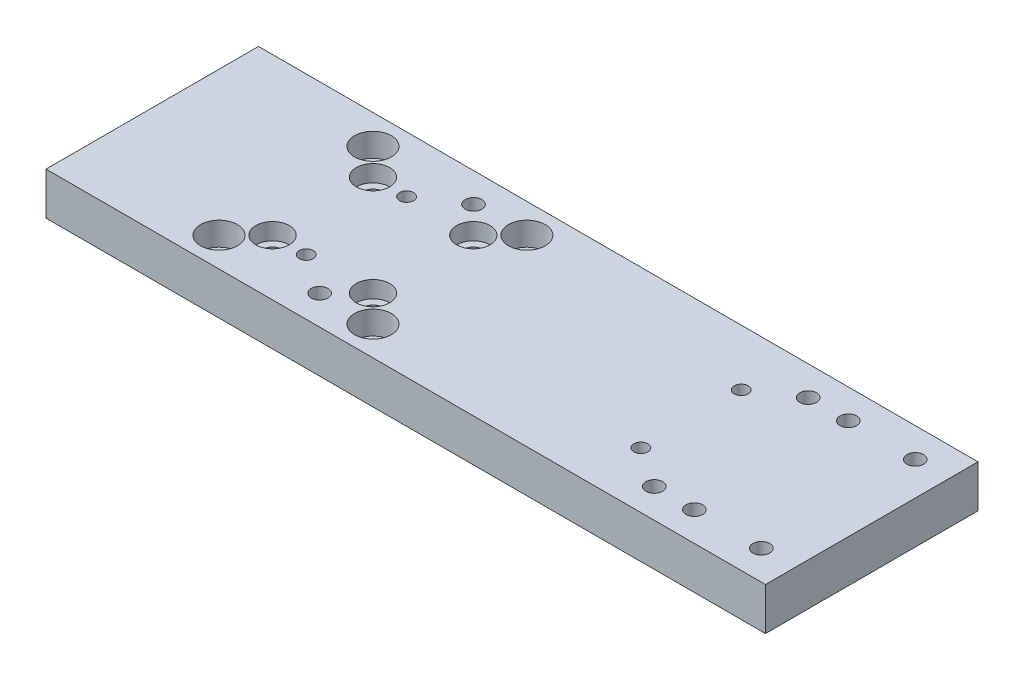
ISO-10303-21;
HEADER;
FILE_DESCRIPTION(('STEP AP214'),'2;1');
FILE_NAME('part.step','',(''),(''),'','','');
FILE_SCHEMA(('AUTOMOTIVE_DESIGN { 1 0 10303 214 1 1 1 1 }'));
ENDSEC;
DATA;
#1=APPLICATION_CONTEXT('core data for automotive mechanical design processes');
#2=APPLICATION_PROTOCOL_DEFINITION('international standard','automotive_design',2000,#1);
#3=PRODUCT_CONTEXT('',#1,'mechanical');
#4=PRODUCT('Part','Part','',(#3));
#5=PRODUCT_RELATED_PRODUCT_CATEGORY('part','',(#4));
#6=PRODUCT_DEFINITION_FORMATION('','',#4);
#7=PRODUCT_DEFINITION_CONTEXT('part definition',#1,'design');
#8=PRODUCT_DEFINITION('design','',#6,#7);
#9=PRODUCT_DEFINITION_SHAPE('','',#8);
#10=(LENGTH_UNIT() NAMED_UNIT(*) SI_UNIT(.MILLI.,.METRE.));
#11=(NAMED_UNIT(*) PLANE_ANGLE_UNIT() SI_UNIT($,.RADIAN.));
#12=(NAMED_UNIT(*) SI_UNIT($,.STERADIAN.) SOLID_ANGLE_UNIT());
#13=UNCERTAINTY_MEASURE_WITH_UNIT(LENGTH_MEASURE(1.E-05),#10,'distance_accuracy_value','');
#14=(GEOMETRIC_REPRESENTATION_CONTEXT(3) GLOBAL_UNCERTAINTY_ASSIGNED_CONTEXT((#13)) GLOBAL_UNIT_ASSIGNED_CONTEXT((#10,
#11,#12)) REPRESENTATION_CONTEXT('',''));
#15=CARTESIAN_POINT('',(0.,0.,0.));
#16=DIRECTION('',(0.,0.,1.));
#17=DIRECTION('',(1.,0.,0.));
#18=AXIS2_PLACEMENT_3D('',#15,#16,#17);
#19=CARTESIAN_POINT('',(0.,12.7,0.));
#20=DIRECTION('',(1.,0.,0.));
#21=DIRECTION('',(0.,0.,-1.));
#22=AXIS2_PLACEMENT_3D('',#19,#20,#21);
#23=PLANE('',#22);
#24=DIRECTION('',(0.,0.,1.));
#25=VECTOR('',#24,1.);
#26=CARTESIAN_POINT('',(0.,0.,0.));
#27=LINE('',#26,#25);
#28=CARTESIAN_POINT('',(0.,0.,-63.5));
#29=VERTEX_POINT('',#28);
#30=CARTESIAN_POINT('',(0.,0.,0.));
#31=VERTEX_POINT('',#30);
#32=EDGE_CURVE('E91',#29,#31,#27,.T.);
#33=ORIENTED_EDGE('',*,*,#32,.T.);
#34=DIRECTION('',(0.,-1.,0.));
#35=VECTOR('',#34,1.);
#36=CARTESIAN_POINT('',(0.,12.7,0.));
#37=LINE('',#36,#35);
#38=CARTESIAN_POINT('',(0.,12.7,0.));
#39=VERTEX_POINT('',#38);
#40=EDGE_CURVE('E12',#39,#31,#37,.T.);
#41=ORIENTED_EDGE('',*,*,#40,.F.);
#42=DIRECTION('',(0.,0.,1.));
#43=VECTOR('',#42,1.);
#44=CARTESIAN_POINT('',(0.,12.7,0.));
#45=LINE('',#44,#43);
#46=CARTESIAN_POINT('',(0.,12.7,-63.5));
#47=VERTEX_POINT('',#46);
#48=EDGE_CURVE('E82',#47,#39,#45,.T.);
#49=ORIENTED_EDGE('',*,*,#48,.F.);
#50=DIRECTION('',(0.,-1.,0.));
#51=VECTOR('',#50,1.);
#52=CARTESIAN_POINT('',(0.,12.7,-63.5));
#53=LINE('',#52,#51);
#54=EDGE_CURVE('E92',#47,#29,#53,.T.);
#55=ORIENTED_EDGE('',*,*,#54,.T.);
#56=EDGE_LOOP('',(#33,#41,#49,#55));
#57=FACE_BOUND('',#56,.T.);
#58=ADVANCED_FACE('F37',(#57),#23,.F.);
#59=CARTESIAN_POINT('',(0.,12.7,0.));
#60=DIRECTION('',(0.,0.,-1.));
#61=DIRECTION('',(-1.,0.,0.));
#62=AXIS2_PLACEMENT_3D('',#59,#60,#61);
#63=PLANE('',#62);
#64=DIRECTION('',(1.,0.,0.));
#65=VECTOR('',#64,1.);
#66=CARTESIAN_POINT('',(0.,0.,0.));
#67=LINE('',#66,#65);
#68=CARTESIAN_POINT('',(215.,0.,0.));
#69=VERTEX_POINT('',#68);
#70=EDGE_CURVE('E95',#31,#69,#67,.T.);
#71=ORIENTED_EDGE('',*,*,#70,.T.);
#72=DIRECTION('',(0.,-1.,0.));
#73=VECTOR('',#72,1.);
#74=CARTESIAN_POINT('',(215.,12.7,0.));
#75=LINE('',#74,#73);
#76=CARTESIAN_POINT('',(215.,12.7,0.));
#77=VERTEX_POINT('',#76);
#78=EDGE_CURVE('E47',#77,#69,#75,.T.);
#79=ORIENTED_EDGE('',*,*,#78,.F.);
#80=DIRECTION('',(1.,0.,0.));
#81=VECTOR('',#80,1.);
#82=CARTESIAN_POINT('',(0.,12.7,0.));
#83=LINE('',#82,#81);
#84=EDGE_CURVE('E73',#39,#77,#83,.T.);
#85=ORIENTED_EDGE('',*,*,#84,.F.);
#86=ORIENTED_EDGE('',*,*,#40,.T.);
#87=EDGE_LOOP('',(#71,#79,#85,#86));
#88=FACE_BOUND('',#87,.T.);
#89=ADVANCED_FACE('F76',(#88),#63,.F.);
#90=CARTESIAN_POINT('',(215.,12.7,0.));
#91=DIRECTION('',(-1.,0.,0.));
#92=DIRECTION('',(0.,0.,1.));
#93=AXIS2_PLACEMENT_3D('',#90,#91,#92);
#94=PLANE('',#93);
#95=DIRECTION('',(0.,0.,-1.));
#96=VECTOR('',#95,1.);
#97=CARTESIAN_POINT('',(215.,0.,-63.5));
#98=LINE('',#97,#96);
#99=CARTESIAN_POINT('',(215.,0.,-63.5));
#100=VERTEX_POINT('',#99);
#101=EDGE_CURVE('E98',#69,#100,#98,.T.);
#102=ORIENTED_EDGE('',*,*,#101,.T.);
#103=DIRECTION('',(0.,-1.,0.));
#104=VECTOR('',#103,1.);
#105=CARTESIAN_POINT('',(215.,12.7,-63.5));
#106=LINE('',#105,#104);
#107=CARTESIAN_POINT('',(215.,12.7,-63.5));
#108=VERTEX_POINT('',#107);
#109=EDGE_CURVE('E41',#108,#100,#106,.T.);
#110=ORIENTED_EDGE('',*,*,#109,.F.);
#111=DIRECTION('',(0.,0.,-1.));
#112=VECTOR('',#111,1.);
#113=CARTESIAN_POINT('',(215.,12.7,-63.5));
#114=LINE('',#113,#112);
#115=EDGE_CURVE('E81',#77,#108,#114,.T.);
#116=ORIENTED_EDGE('',*,*,#115,.F.);
#117=ORIENTED_EDGE('',*,*,#78,.T.);
#118=EDGE_LOOP('',(#102,#110,#116,#117));
#119=FACE_BOUND('',#118,.T.);
#120=ADVANCED_FACE('F39',(#119),#94,.F.);
#121=CARTESIAN_POINT('',(0.,12.7,-63.5));
#122=DIRECTION('',(0.,0.,1.));
#123=DIRECTION('',(1.,0.,0.));
#124=AXIS2_PLACEMENT_3D('',#121,#122,#123);
#125=PLANE('',#124);
#126=DIRECTION('',(-1.,0.,0.));
#127=VECTOR('',#126,1.);
#128=CARTESIAN_POINT('',(0.,0.,-63.5));
#129=LINE('',#128,#127);
#130=EDGE_CURVE('E88',#100,#29,#129,.T.);
#131=ORIENTED_EDGE('',*,*,#130,.T.);
#132=ORIENTED_EDGE('',*,*,#54,.F.);
#133=DIRECTION('',(-1.,0.,0.));
#134=VECTOR('',#133,1.);
#135=CARTESIAN_POINT('',(0.,12.7,-63.5));
#136=LINE('',#135,#134);
#137=EDGE_CURVE('E56',#108,#47,#136,.T.);
#138=ORIENTED_EDGE('',*,*,#137,.F.);
#139=ORIENTED_EDGE('',*,*,#109,.T.);
#140=EDGE_LOOP('',(#131,#132,#138,#139));
#141=FACE_BOUND('',#140,.T.);
#142=ADVANCED_FACE('F114',(#141),#125,.F.);
#143=CARTESIAN_POINT('',(0.,12.7,-63.5));
#144=DIRECTION('',(0.,-1.,0.));
#145=DIRECTION('',(0.,0.,-1.));
#146=AXIS2_PLACEMENT_3D('',#143,#144,#145);
#147=PLANE('',#146);
#148=CARTESIAN_POINT('',(173.,12.7,-54.75));
#149=DIRECTION('',(0.,1.,0.));
#150=DIRECTION('',(0.,0.,1.));
#151=AXIS2_PLACEMENT_3D('',#148,#149,#150);
#152=CIRCLE('',#151,2.49999999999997);
#153=CARTESIAN_POINT('',(173.,12.7,-52.2500000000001));
#154=VERTEX_POINT('',#153);
#155=EDGE_CURVE('E711',#154,#154,#152,.T.);
#156=ORIENTED_EDGE('',*,*,#155,.F.);
#157=EDGE_LOOP('',(#156));
#158=FACE_BOUND('',#157,.T.);
#159=CARTESIAN_POINT('',(173.,12.7,-8.75000000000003));
#160=DIRECTION('',(0.,1.,0.));
#161=DIRECTION('',(0.,0.,1.));
#162=AXIS2_PLACEMENT_3D('',#159,#160,#161);
#163=CIRCLE('',#162,2.49999999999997);
#164=CARTESIAN_POINT('',(173.,12.7,-6.25000000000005));
#165=VERTEX_POINT('',#164);
#166=EDGE_CURVE('E706',#165,#165,#163,.T.);
#167=ORIENTED_EDGE('',*,*,#166,.F.);
#168=EDGE_LOOP('',(#167));
#169=FACE_BOUND('',#168,.T.);
#170=CARTESIAN_POINT('',(73.,12.7,-8.75000000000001));
#171=DIRECTION('',(0.,1.,0.));
#172=DIRECTION('',(0.,0.,1.));
#173=AXIS2_PLACEMENT_3D('',#170,#171,#172);
#174=CIRCLE('',#173,2.49999999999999);
#175=CARTESIAN_POINT('',(73.,12.7,-6.25000000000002));
#176=VERTEX_POINT('',#175);
#177=EDGE_CURVE('E700',#176,#176,#174,.T.);
#178=ORIENTED_EDGE('',*,*,#177,.F.);
#179=EDGE_LOOP('',(#178));
#180=FACE_BOUND('',#179,.T.);
#181=CARTESIAN_POINT('',(73.,12.7,-54.75));
#182=DIRECTION('',(0.,1.,0.));
#183=DIRECTION('',(0.,0.,1.));
#184=AXIS2_PLACEMENT_3D('',#181,#182,#183);
#185=CIRCLE('',#184,2.49999999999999);
#186=CARTESIAN_POINT('',(73.,12.7,-52.25));
#187=VERTEX_POINT('',#186);
#188=EDGE_CURVE('E694',#187,#187,#185,.T.);
#189=ORIENTED_EDGE('',*,*,#188,.F.);
#190=EDGE_LOOP('',(#189));
#191=FACE_BOUND('',#190,.T.);
#192=CARTESIAN_POINT('',(205.,12.7,-8.75000000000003));
#193=DIRECTION('',(0.,1.,0.));
#194=DIRECTION('',(0.,0.,1.));
#195=AXIS2_PLACEMENT_3D('',#192,#193,#194);
#196=CIRCLE('',#195,2.5);
#197=CARTESIAN_POINT('',(205.,12.7,-6.25000000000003));
#198=VERTEX_POINT('',#197);
#199=EDGE_CURVE('E688',#198,#198,#196,.T.);
#200=ORIENTED_EDGE('',*,*,#199,.F.);
#201=EDGE_LOOP('',(#200));
#202=FACE_BOUND('',#201,.T.);
#203=CARTESIAN_POINT('',(205.,12.7,-54.75));
#204=DIRECTION('',(0.,1.,0.));
#205=DIRECTION('',(0.,0.,1.));
#206=AXIS2_PLACEMENT_3D('',#203,#204,#205);
#207=CIRCLE('',#206,2.5);
#208=CARTESIAN_POINT('',(205.,12.7,-52.25));
#209=VERTEX_POINT('',#208);
#210=EDGE_CURVE('E682',#209,#209,#207,.T.);
#211=ORIENTED_EDGE('',*,*,#210,.F.);
#212=EDGE_LOOP('',(#211));
#213=FACE_BOUND('',#212,.T.);
#214=CARTESIAN_POINT('',(185.,12.7,-54.75));
#215=DIRECTION('',(0.,1.,0.));
#216=DIRECTION('',(0.,0.,1.));
#217=AXIS2_PLACEMENT_3D('',#214,#215,#216);
#218=CIRCLE('',#217,2.49999999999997);
#219=CARTESIAN_POINT('',(185.,12.7,-52.25));
#220=VERTEX_POINT('',#219);
#221=EDGE_CURVE('E676',#220,#220,#218,.T.);
#222=ORIENTED_EDGE('',*,*,#221,.F.);
#223=EDGE_LOOP('',(#222));
#224=FACE_BOUND('',#223,.T.);
#225=CARTESIAN_POINT('',(185.,12.7,-8.75000000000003));
#226=DIRECTION('',(0.,1.,0.));
#227=DIRECTION('',(0.,0.,1.));
#228=AXIS2_PLACEMENT_3D('',#225,#226,#227);
#229=CIRCLE('',#228,2.49999999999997);
#230=CARTESIAN_POINT('',(185.,12.7,-6.25000000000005));
#231=VERTEX_POINT('',#230);
#232=EDGE_CURVE('E670',#231,#231,#229,.T.);
#233=ORIENTED_EDGE('',*,*,#232,.F.);
#234=EDGE_LOOP('',(#233));
#235=FACE_BOUND('',#234,.T.);
#236=CARTESIAN_POINT('',(88.95,12.7,-8.74999999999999));
#237=DIRECTION('',(0.,1.,0.));
#238=DIRECTION('',(0.,0.,1.));
#239=AXIS2_PLACEMENT_3D('',#236,#237,#238);
#240=CIRCLE('',#239,5.50000000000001);
#241=CARTESIAN_POINT('',(88.95,12.7,-3.24999999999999));
#242=VERTEX_POINT('',#241);
#243=EDGE_CURVE('E664',#242,#242,#240,.T.);
#244=ORIENTED_EDGE('',*,*,#243,.F.);
#245=EDGE_LOOP('',(#244));
#246=FACE_BOUND('',#245,.T.);
#247=CARTESIAN_POINT('',(88.95,12.7,-54.75));
#248=DIRECTION('',(0.,1.,0.));
#249=DIRECTION('',(0.,0.,1.));
#250=AXIS2_PLACEMENT_3D('',#247,#248,#249);
#251=CIRCLE('',#250,5.49999999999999);
#252=CARTESIAN_POINT('',(88.95,12.7,-49.25));
#253=VERTEX_POINT('',#252);
#254=EDGE_CURVE('E652',#253,#253,#251,.T.);
#255=ORIENTED_EDGE('',*,*,#254,.F.);
#256=EDGE_LOOP('',(#255));
#257=FACE_BOUND('',#256,.T.);
#258=CARTESIAN_POINT('',(42.95,12.7,-54.75));
#259=DIRECTION('',(0.,1.,0.));
#260=DIRECTION('',(0.,0.,1.));
#261=AXIS2_PLACEMENT_3D('',#258,#259,#260);
#262=CIRCLE('',#261,5.5);
#263=CARTESIAN_POINT('',(42.95,12.7,-49.25));
#264=VERTEX_POINT('',#263);
#265=EDGE_CURVE('E640',#264,#264,#262,.T.);
#266=ORIENTED_EDGE('',*,*,#265,.F.);
#267=EDGE_LOOP('',(#266));
#268=FACE_BOUND('',#267,.T.);
#269=CARTESIAN_POINT('',(42.95,12.7,-8.74999999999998));
#270=DIRECTION('',(0.,1.,0.));
#271=DIRECTION('',(0.,0.,1.));
#272=AXIS2_PLACEMENT_3D('',#269,#270,#271);
#273=CIRCLE('',#272,5.5);
#274=CARTESIAN_POINT('',(42.95,12.7,-3.24999999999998));
#275=VERTEX_POINT('',#274);
#276=EDGE_CURVE('E628',#275,#275,#273,.T.);
#277=ORIENTED_EDGE('',*,*,#276,.F.);
#278=EDGE_LOOP('',(#277));
#279=FACE_BOUND('',#278,.T.);
#280=CARTESIAN_POINT('',(80.95,12.7,-46.75));
#281=DIRECTION('',(0.,1.,0.));
#282=DIRECTION('',(0.,0.,1.));
#283=AXIS2_PLACEMENT_3D('',#280,#281,#282);
#284=CIRCLE('',#283,5.);
#285=CARTESIAN_POINT('',(80.95,12.7,-41.75));
#286=VERTEX_POINT('',#285);
#287=EDGE_CURVE('E616',#286,#286,#284,.T.);
#288=ORIENTED_EDGE('',*,*,#287,.F.);
#289=EDGE_LOOP('',(#288));
#290=FACE_BOUND('',#289,.T.);
#291=CARTESIAN_POINT('',(80.95,12.7,-16.75));
#292=DIRECTION('',(0.,1.,0.));
#293=DIRECTION('',(0.,0.,1.));
#294=AXIS2_PLACEMENT_3D('',#291,#292,#293);
#295=CIRCLE('',#294,5.);
#296=CARTESIAN_POINT('',(80.95,12.7,-11.75));
#297=VERTEX_POINT('',#296);
#298=EDGE_CURVE('E604',#297,#297,#295,.T.);
#299=ORIENTED_EDGE('',*,*,#298,.F.);
#300=EDGE_LOOP('',(#299));
#301=FACE_BOUND('',#300,.T.);
#302=CARTESIAN_POINT('',(50.95,12.7,-16.75));
#303=DIRECTION('',(0.,1.,0.));
#304=DIRECTION('',(0.,0.,1.));
#305=AXIS2_PLACEMENT_3D('',#302,#303,#304);
#306=CIRCLE('',#305,5.);
#307=CARTESIAN_POINT('',(50.95,12.7,-11.75));
#308=VERTEX_POINT('',#307);
#309=EDGE_CURVE('E592',#308,#308,#306,.T.);
#310=ORIENTED_EDGE('',*,*,#309,.F.);
#311=EDGE_LOOP('',(#310));
#312=FACE_BOUND('',#311,.T.);
#313=CARTESIAN_POINT('',(50.95,12.7,-46.75));
#314=DIRECTION('',(0.,1.,0.));
#315=DIRECTION('',(0.,0.,1.));
#316=AXIS2_PLACEMENT_3D('',#313,#314,#315);
#317=CIRCLE('',#316,5.);
#318=CARTESIAN_POINT('',(50.95,12.7,-41.75));
#319=VERTEX_POINT('',#318);
#320=EDGE_CURVE('E580',#319,#319,#317,.T.);
#321=ORIENTED_EDGE('',*,*,#320,.F.);
#322=EDGE_LOOP('',(#321));
#323=FACE_BOUND('',#322,.T.);
#324=CARTESIAN_POINT('',(161.,12.7,-16.75));
#325=DIRECTION('',(0.,1.,0.));
#326=DIRECTION('',(0.,0.,1.));
#327=AXIS2_PLACEMENT_3D('',#324,#325,#326);
#328=CIRCLE('',#327,2.09999999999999);
#329=CARTESIAN_POINT('',(161.,12.7,-14.65));
#330=VERTEX_POINT('',#329);
#331=EDGE_CURVE('E568',#330,#330,#328,.T.);
#332=ORIENTED_EDGE('',*,*,#331,.F.);
#333=EDGE_LOOP('',(#332));
#334=FACE_BOUND('',#333,.T.);
#335=CARTESIAN_POINT('',(161.,12.7,-46.75));
#336=DIRECTION('',(0.,1.,0.));
#337=DIRECTION('',(0.,0.,1.));
#338=AXIS2_PLACEMENT_3D('',#335,#336,#337);
#339=CIRCLE('',#338,2.09999999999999);
#340=CARTESIAN_POINT('',(161.,12.7,-44.65));
#341=VERTEX_POINT('',#340);
#342=EDGE_CURVE('E555',#341,#341,#339,.T.);
#343=ORIENTED_EDGE('',*,*,#342,.F.);
#344=EDGE_LOOP('',(#343));
#345=FACE_BOUND('',#344,.T.);
#346=CARTESIAN_POINT('',(61.,12.7,-46.75));
#347=DIRECTION('',(0.,1.,0.));
#348=DIRECTION('',(0.,0.,1.));
#349=AXIS2_PLACEMENT_3D('',#346,#347,#348);
#350=CIRCLE('',#349,2.1);
#351=CARTESIAN_POINT('',(61.,12.7,-44.65));
#352=VERTEX_POINT('',#351);
#353=EDGE_CURVE('E549',#352,#352,#350,.T.);
#354=ORIENTED_EDGE('',*,*,#353,.F.);
#355=EDGE_LOOP('',(#354));
#356=FACE_BOUND('',#355,.T.);
#357=CARTESIAN_POINT('',(61.,12.7,-16.75));
#358=DIRECTION('',(0.,1.,0.));
#359=DIRECTION('',(0.,0.,1.));
#360=AXIS2_PLACEMENT_3D('',#357,#358,#359);
#361=CIRCLE('',#360,2.1);
#362=CARTESIAN_POINT('',(61.,12.7,-14.65));
#363=VERTEX_POINT('',#362);
#364=EDGE_CURVE('E101',#363,#363,#361,.T.);
#365=ORIENTED_EDGE('',*,*,#364,.F.);
#366=EDGE_LOOP('',(#365));
#367=FACE_BOUND('',#366,.T.);
#368=ORIENTED_EDGE('',*,*,#48,.T.);
#369=ORIENTED_EDGE('',*,*,#84,.T.);
#370=ORIENTED_EDGE('',*,*,#115,.T.);
#371=ORIENTED_EDGE('',*,*,#137,.T.);
#372=EDGE_LOOP('',(#368,#369,#370,#371));
#373=FACE_BOUND('',#372,.T.);
#374=ADVANCED_FACE('F85',(#158,#169,#180,#191,#202,#213,#224,#235,#246,#257,#268,#279,#290,#301,
#312,#323,#334,#345,#356,#367,#373),#147,.F.);
#375=CARTESIAN_POINT('',(0.,0.,-63.5));
#376=DIRECTION('',(0.,-1.,0.));
#377=DIRECTION('',(0.,0.,-1.));
#378=AXIS2_PLACEMENT_3D('',#375,#376,#377);
#379=PLANE('',#378);
#380=CARTESIAN_POINT('',(173.,0.,-54.75));
#381=DIRECTION('',(0.,1.,0.));
#382=DIRECTION('',(0.,0.,1.));
#383=AXIS2_PLACEMENT_3D('',#380,#381,#382);
#384=CIRCLE('',#383,2.5);
#385=CARTESIAN_POINT('',(173.,0.,-52.25));
#386=VERTEX_POINT('',#385);
#387=EDGE_CURVE('E709',#386,#386,#384,.T.);
#388=ORIENTED_EDGE('',*,*,#387,.T.);
#389=EDGE_LOOP('',(#388));
#390=FACE_BOUND('',#389,.T.);
#391=CARTESIAN_POINT('',(173.,0.,-8.75000000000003));
#392=DIRECTION('',(0.,1.,0.));
#393=DIRECTION('',(0.,0.,1.));
#394=AXIS2_PLACEMENT_3D('',#391,#392,#393);
#395=CIRCLE('',#394,2.5);
#396=CARTESIAN_POINT('',(173.,0.,-6.25000000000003));
#397=VERTEX_POINT('',#396);
#398=EDGE_CURVE('E703',#397,#397,#395,.T.);
#399=ORIENTED_EDGE('',*,*,#398,.T.);
#400=EDGE_LOOP('',(#399));
#401=FACE_BOUND('',#400,.T.);
#402=CARTESIAN_POINT('',(73.,0.,-8.75000000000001));
#403=DIRECTION('',(0.,1.,0.));
#404=DIRECTION('',(0.,0.,1.));
#405=AXIS2_PLACEMENT_3D('',#402,#403,#404);
#406=CIRCLE('',#405,2.5);
#407=CARTESIAN_POINT('',(73.,0.,-6.25));
#408=VERTEX_POINT('',#407);
#409=EDGE_CURVE('E697',#408,#408,#406,.T.);
#410=ORIENTED_EDGE('',*,*,#409,.T.);
#411=EDGE_LOOP('',(#410));
#412=FACE_BOUND('',#411,.T.);
#413=CARTESIAN_POINT('',(73.,0.,-54.75));
#414=DIRECTION('',(0.,1.,0.));
#415=DIRECTION('',(0.,0.,1.));
#416=AXIS2_PLACEMENT_3D('',#413,#414,#415);
#417=CIRCLE('',#416,2.5);
#418=CARTESIAN_POINT('',(73.,0.,-52.25));
#419=VERTEX_POINT('',#418);
#420=EDGE_CURVE('E691',#419,#419,#417,.T.);
#421=ORIENTED_EDGE('',*,*,#420,.T.);
#422=EDGE_LOOP('',(#421));
#423=FACE_BOUND('',#422,.T.);
#424=CARTESIAN_POINT('',(205.,0.,-8.75000000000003));
#425=DIRECTION('',(0.,1.,0.));
#426=DIRECTION('',(0.,0.,1.));
#427=AXIS2_PLACEMENT_3D('',#424,#425,#426);
#428=CIRCLE('',#427,2.5);
#429=CARTESIAN_POINT('',(205.,0.,-6.25000000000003));
#430=VERTEX_POINT('',#429);
#431=EDGE_CURVE('E685',#430,#430,#428,.T.);
#432=ORIENTED_EDGE('',*,*,#431,.T.);
#433=EDGE_LOOP('',(#432));
#434=FACE_BOUND('',#433,.T.);
#435=CARTESIAN_POINT('',(205.,0.,-54.75));
#436=DIRECTION('',(0.,1.,0.));
#437=DIRECTION('',(0.,0.,1.));
#438=AXIS2_PLACEMENT_3D('',#435,#436,#437);
#439=CIRCLE('',#438,2.5);
#440=CARTESIAN_POINT('',(205.,0.,-52.25));
#441=VERTEX_POINT('',#440);
#442=EDGE_CURVE('E679',#441,#441,#439,.T.);
#443=ORIENTED_EDGE('',*,*,#442,.T.);
#444=EDGE_LOOP('',(#443));
#445=FACE_BOUND('',#444,.T.);
#446=CARTESIAN_POINT('',(185.,0.,-54.75));
#447=DIRECTION('',(0.,1.,0.));
#448=DIRECTION('',(0.,0.,1.));
#449=AXIS2_PLACEMENT_3D('',#446,#447,#448);
#450=CIRCLE('',#449,2.5);
#451=CARTESIAN_POINT('',(185.,0.,-52.25));
#452=VERTEX_POINT('',#451);
#453=EDGE_CURVE('E673',#452,#452,#450,.T.);
#454=ORIENTED_EDGE('',*,*,#453,.T.);
#455=EDGE_LOOP('',(#454));
#456=FACE_BOUND('',#455,.T.);
#457=CARTESIAN_POINT('',(185.,0.,-8.75000000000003));
#458=DIRECTION('',(0.,1.,0.));
#459=DIRECTION('',(0.,0.,1.));
#460=AXIS2_PLACEMENT_3D('',#457,#458,#459);
#461=CIRCLE('',#460,2.5);
#462=CARTESIAN_POINT('',(185.,0.,-6.25000000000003));
#463=VERTEX_POINT('',#462);
#464=EDGE_CURVE('E667',#463,#463,#461,.T.);
#465=ORIENTED_EDGE('',*,*,#464,.T.);
#466=EDGE_LOOP('',(#465));
#467=FACE_BOUND('',#466,.T.);
#468=CARTESIAN_POINT('',(88.95,0.,-8.74999999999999));
#469=DIRECTION('',(0.,1.,0.));
#470=DIRECTION('',(0.,0.,1.));
#471=AXIS2_PLACEMENT_3D('',#468,#469,#470);
#472=CIRCLE('',#471,3.3);
#473=CARTESIAN_POINT('',(88.95,0.,-5.45));
#474=VERTEX_POINT('',#473);
#475=EDGE_CURVE('E655',#474,#474,#472,.T.);
#476=ORIENTED_EDGE('',*,*,#475,.T.);
#477=EDGE_LOOP('',(#476));
#478=FACE_BOUND('',#477,.T.);
#479=CARTESIAN_POINT('',(88.95,0.,-54.75));
#480=DIRECTION('',(0.,1.,0.));
#481=DIRECTION('',(0.,0.,1.));
#482=AXIS2_PLACEMENT_3D('',#479,#480,#481);
#483=CIRCLE('',#482,3.3);
#484=CARTESIAN_POINT('',(88.95,0.,-51.45));
#485=VERTEX_POINT('',#484);
#486=EDGE_CURVE('E643',#485,#485,#483,.T.);
#487=ORIENTED_EDGE('',*,*,#486,.T.);
#488=EDGE_LOOP('',(#487));
#489=FACE_BOUND('',#488,.T.);
#490=CARTESIAN_POINT('',(42.95,0.,-54.75));
#491=DIRECTION('',(0.,1.,0.));
#492=DIRECTION('',(0.,0.,1.));
#493=AXIS2_PLACEMENT_3D('',#490,#491,#492);
#494=CIRCLE('',#493,3.3);
#495=CARTESIAN_POINT('',(42.95,0.,-51.45));
#496=VERTEX_POINT('',#495);
#497=EDGE_CURVE('E631',#496,#496,#494,.T.);
#498=ORIENTED_EDGE('',*,*,#497,.T.);
#499=EDGE_LOOP('',(#498));
#500=FACE_BOUND('',#499,.T.);
#501=CARTESIAN_POINT('',(42.95,0.,-8.74999999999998));
#502=DIRECTION('',(0.,1.,0.));
#503=DIRECTION('',(0.,0.,1.));
#504=AXIS2_PLACEMENT_3D('',#501,#502,#503);
#505=CIRCLE('',#504,3.3);
#506=CARTESIAN_POINT('',(42.95,0.,-5.44999999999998));
#507=VERTEX_POINT('',#506);
#508=EDGE_CURVE('E619',#507,#507,#505,.T.);
#509=ORIENTED_EDGE('',*,*,#508,.T.);
#510=EDGE_LOOP('',(#509));
#511=FACE_BOUND('',#510,.T.);
#512=CARTESIAN_POINT('',(80.95,0.,-46.75));
#513=DIRECTION('',(0.,1.,0.));
#514=DIRECTION('',(0.,0.,1.));
#515=AXIS2_PLACEMENT_3D('',#512,#513,#514);
#516=CIRCLE('',#515,2.75);
#517=CARTESIAN_POINT('',(80.95,0.,-44.));
#518=VERTEX_POINT('',#517);
#519=EDGE_CURVE('E607',#518,#518,#516,.T.);
#520=ORIENTED_EDGE('',*,*,#519,.T.);
#521=EDGE_LOOP('',(#520));
#522=FACE_BOUND('',#521,.T.);
#523=CARTESIAN_POINT('',(80.95,0.,-16.75));
#524=DIRECTION('',(0.,1.,0.));
#525=DIRECTION('',(0.,0.,1.));
#526=AXIS2_PLACEMENT_3D('',#523,#524,#525);
#527=CIRCLE('',#526,2.75);
#528=CARTESIAN_POINT('',(80.95,0.,-14.));
#529=VERTEX_POINT('',#528);
#530=EDGE_CURVE('E595',#529,#529,#527,.T.);
#531=ORIENTED_EDGE('',*,*,#530,.T.);
#532=EDGE_LOOP('',(#531));
#533=FACE_BOUND('',#532,.T.);
#534=CARTESIAN_POINT('',(50.95,0.,-16.75));
#535=DIRECTION('',(0.,1.,0.));
#536=DIRECTION('',(0.,0.,1.));
#537=AXIS2_PLACEMENT_3D('',#534,#535,#536);
#538=CIRCLE('',#537,2.75);
#539=CARTESIAN_POINT('',(50.95,0.,-14.));
#540=VERTEX_POINT('',#539);
#541=EDGE_CURVE('E583',#540,#540,#538,.T.);
#542=ORIENTED_EDGE('',*,*,#541,.T.);
#543=EDGE_LOOP('',(#542));
#544=FACE_BOUND('',#543,.T.);
#545=CARTESIAN_POINT('',(50.95,0.,-46.75));
#546=DIRECTION('',(0.,1.,0.));
#547=DIRECTION('',(0.,0.,1.));
#548=AXIS2_PLACEMENT_3D('',#545,#546,#547);
#549=CIRCLE('',#548,2.75);
#550=CARTESIAN_POINT('',(50.95,0.,-44.));
#551=VERTEX_POINT('',#550);
#552=EDGE_CURVE('E571',#551,#551,#549,.T.);
#553=ORIENTED_EDGE('',*,*,#552,.T.);
#554=EDGE_LOOP('',(#553));
#555=FACE_BOUND('',#554,.T.);
#556=CARTESIAN_POINT('',(161.,0.,-16.75));
#557=DIRECTION('',(0.,1.,0.));
#558=DIRECTION('',(0.,0.,1.));
#559=AXIS2_PLACEMENT_3D('',#556,#557,#558);
#560=CIRCLE('',#559,2.09999999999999);
#561=CARTESIAN_POINT('',(161.,0.,-14.65));
#562=VERTEX_POINT('',#561);
#563=EDGE_CURVE('E565',#562,#562,#560,.T.);
#564=ORIENTED_EDGE('',*,*,#563,.T.);
#565=EDGE_LOOP('',(#564));
#566=FACE_BOUND('',#565,.T.);
#567=CARTESIAN_POINT('',(161.,0.,-46.75));
#568=DIRECTION('',(0.,1.,0.));
#569=DIRECTION('',(0.,0.,1.));
#570=AXIS2_PLACEMENT_3D('',#567,#568,#569);
#571=CIRCLE('',#570,2.09999999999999);
#572=CARTESIAN_POINT('',(161.,0.,-44.65));
#573=VERTEX_POINT('',#572);
#574=EDGE_CURVE('E551',#573,#573,#571,.T.);
#575=ORIENTED_EDGE('',*,*,#574,.T.);
#576=EDGE_LOOP('',(#575));
#577=FACE_BOUND('',#576,.T.);
#578=CARTESIAN_POINT('',(61.,0.,-46.75));
#579=DIRECTION('',(0.,1.,0.));
#580=DIRECTION('',(0.,0.,1.));
#581=AXIS2_PLACEMENT_3D('',#578,#579,#580);
#582=CIRCLE('',#581,2.09999999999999);
#583=CARTESIAN_POINT('',(61.,0.,-44.65));
#584=VERTEX_POINT('',#583);
#585=EDGE_CURVE('E546',#584,#584,#582,.T.);
#586=ORIENTED_EDGE('',*,*,#585,.T.);
#587=EDGE_LOOP('',(#586));
#588=FACE_BOUND('',#587,.T.);
#589=CARTESIAN_POINT('',(61.,0.,-16.75));
#590=DIRECTION('',(0.,1.,0.));
#591=DIRECTION('',(0.,0.,1.));
#592=AXIS2_PLACEMENT_3D('',#589,#590,#591);
#593=CIRCLE('',#592,2.1);
#594=CARTESIAN_POINT('',(61.,0.,-14.65));
#595=VERTEX_POINT('',#594);
#596=EDGE_CURVE('E96',#595,#595,#593,.T.);
#597=ORIENTED_EDGE('',*,*,#596,.T.);
#598=EDGE_LOOP('',(#597));
#599=FACE_BOUND('',#598,.T.);
#600=ORIENTED_EDGE('',*,*,#32,.F.);
#601=ORIENTED_EDGE('',*,*,#130,.F.);
#602=ORIENTED_EDGE('',*,*,#101,.F.);
#603=ORIENTED_EDGE('',*,*,#70,.F.);
#604=EDGE_LOOP('',(#600,#601,#602,#603));
#605=FACE_BOUND('',#604,.T.);
#606=ADVANCED_FACE('F115',(#390,#401,#412,#423,#434,#445,#456,#467,#478,#489,#500,#511,#522,
#533,#544,#555,#566,#577,#588,#599,#605),#379,.T.);
#607=CARTESIAN_POINT('',(61.,12.7,-16.75));
#608=DIRECTION('',(0.,1.,0.));
#609=DIRECTION('',(0.,0.,1.));
#610=AXIS2_PLACEMENT_3D('',#607,#608,#609);
#611=CYLINDRICAL_SURFACE('',#610,2.1);
#612=ORIENTED_EDGE('',*,*,#596,.F.);
#613=EDGE_LOOP('',(#612));
#614=FACE_BOUND('',#613,.T.);
#615=ORIENTED_EDGE('',*,*,#364,.T.);
#616=EDGE_LOOP('',(#615));
#617=FACE_BOUND('',#616,.T.);
#618=ADVANCED_FACE('F117',(#614,#617),#611,.F.);
#619=CARTESIAN_POINT('',(61.,12.7,-46.75));
#620=DIRECTION('',(0.,1.,0.));
#621=DIRECTION('',(0.,0.,1.));
#622=AXIS2_PLACEMENT_3D('',#619,#620,#621);
#623=CYLINDRICAL_SURFACE('',#622,2.1);
#624=ORIENTED_EDGE('',*,*,#585,.F.);
#625=EDGE_LOOP('',(#624));
#626=FACE_BOUND('',#625,.T.);
#627=ORIENTED_EDGE('',*,*,#353,.T.);
#628=EDGE_LOOP('',(#627));
#629=FACE_BOUND('',#628,.T.);
#630=ADVANCED_FACE('F124',(#626,#629),#623,.F.);
#631=CARTESIAN_POINT('',(161.,12.7,-46.75));
#632=DIRECTION('',(0.,1.,0.));
#633=DIRECTION('',(0.,0.,1.));
#634=AXIS2_PLACEMENT_3D('',#631,#632,#633);
#635=CYLINDRICAL_SURFACE('',#634,2.09999999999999);
#636=ORIENTED_EDGE('',*,*,#574,.F.);
#637=EDGE_LOOP('',(#636));
#638=FACE_BOUND('',#637,.T.);
#639=ORIENTED_EDGE('',*,*,#342,.T.);
#640=EDGE_LOOP('',(#639));
#641=FACE_BOUND('',#640,.T.);
#642=ADVANCED_FACE('F488',(#638,#641),#635,.F.);
#643=CARTESIAN_POINT('',(161.,12.7,-16.75));
#644=DIRECTION('',(0.,1.,0.));
#645=DIRECTION('',(0.,0.,1.));
#646=AXIS2_PLACEMENT_3D('',#643,#644,#645);
#647=CYLINDRICAL_SURFACE('',#646,2.09999999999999);
#648=ORIENTED_EDGE('',*,*,#563,.F.);
#649=EDGE_LOOP('',(#648));
#650=FACE_BOUND('',#649,.T.);
#651=ORIENTED_EDGE('',*,*,#331,.T.);
#652=EDGE_LOOP('',(#651));
#653=FACE_BOUND('',#652,.T.);
#654=ADVANCED_FACE('F477',(#650,#653),#647,.F.);
#655=CARTESIAN_POINT('',(50.95,12.7,-46.75));
#656=DIRECTION('',(0.,1.,0.));
#657=DIRECTION('',(0.,0.,1.));
#658=AXIS2_PLACEMENT_3D('',#655,#656,#657);
#659=CYLINDRICAL_SURFACE('',#658,2.75);
#660=ORIENTED_EDGE('',*,*,#552,.F.);
#661=EDGE_LOOP('',(#660));
#662=FACE_BOUND('',#661,.T.);
#663=CARTESIAN_POINT('',(50.95,7.7,-46.75));
#664=DIRECTION('',(0.,1.,0.));
#665=DIRECTION('',(0.,0.,1.));
#666=AXIS2_PLACEMENT_3D('',#663,#664,#665);
#667=CIRCLE('',#666,2.75);
#668=CARTESIAN_POINT('',(50.95,7.7,-44.));
#669=VERTEX_POINT('',#668);
#670=EDGE_CURVE('E574',#669,#669,#667,.T.);
#671=ORIENTED_EDGE('',*,*,#670,.T.);
#672=EDGE_LOOP('',(#671));
#673=FACE_BOUND('',#672,.T.);
#674=ADVANCED_FACE('F467',(#662,#673),#659,.F.);
#675=CARTESIAN_POINT('',(53.7,7.7,-46.75));
#676=DIRECTION('',(0.,-1.,0.));
#677=DIRECTION('',(0.,0.,-1.));
#678=AXIS2_PLACEMENT_3D('',#675,#676,#677);
#679=PLANE('',#678);
#680=ORIENTED_EDGE('',*,*,#670,.F.);
#681=EDGE_LOOP('',(#680));
#682=FACE_BOUND('',#681,.T.);
#683=CARTESIAN_POINT('',(50.95,7.7,-46.75));
#684=DIRECTION('',(0.,1.,0.));
#685=DIRECTION('',(0.,0.,1.));
#686=AXIS2_PLACEMENT_3D('',#683,#684,#685);
#687=CIRCLE('',#686,5.);
#688=CARTESIAN_POINT('',(50.95,7.7,-41.75));
#689=VERTEX_POINT('',#688);
#690=EDGE_CURVE('E577',#689,#689,#687,.T.);
#691=ORIENTED_EDGE('',*,*,#690,.T.);
#692=EDGE_LOOP('',(#691));
#693=FACE_BOUND('',#692,.T.);
#694=ADVANCED_FACE('F457',(#682,#693),#679,.F.);
#695=CARTESIAN_POINT('',(50.95,12.7,-46.75));
#696=DIRECTION('',(0.,1.,0.));
#697=DIRECTION('',(0.,0.,1.));
#698=AXIS2_PLACEMENT_3D('',#695,#696,#697);
#699=CYLINDRICAL_SURFACE('',#698,5.);
#700=ORIENTED_EDGE('',*,*,#690,.F.);
#701=EDGE_LOOP('',(#700));
#702=FACE_BOUND('',#701,.T.);
#703=ORIENTED_EDGE('',*,*,#320,.T.);
#704=EDGE_LOOP('',(#703));
#705=FACE_BOUND('',#704,.T.);
#706=ADVANCED_FACE('F447',(#702,#705),#699,.F.);
#707=CARTESIAN_POINT('',(50.95,12.7,-16.75));
#708=DIRECTION('',(0.,1.,0.));
#709=DIRECTION('',(0.,0.,1.));
#710=AXIS2_PLACEMENT_3D('',#707,#708,#709);
#711=CYLINDRICAL_SURFACE('',#710,2.75);
#712=ORIENTED_EDGE('',*,*,#541,.F.);
#713=EDGE_LOOP('',(#712));
#714=FACE_BOUND('',#713,.T.);
#715=CARTESIAN_POINT('',(50.95,7.7,-16.75));
#716=DIRECTION('',(0.,1.,0.));
#717=DIRECTION('',(0.,0.,1.));
#718=AXIS2_PLACEMENT_3D('',#715,#716,#717);
#719=CIRCLE('',#718,2.75);
#720=CARTESIAN_POINT('',(50.95,7.7,-14.));
#721=VERTEX_POINT('',#720);
#722=EDGE_CURVE('E586',#721,#721,#719,.T.);
#723=ORIENTED_EDGE('',*,*,#722,.T.);
#724=EDGE_LOOP('',(#723));
#725=FACE_BOUND('',#724,.T.);
#726=ADVANCED_FACE('F437',(#714,#725),#711,.F.);
#727=CARTESIAN_POINT('',(53.7,7.7,-16.75));
#728=DIRECTION('',(0.,-1.,0.));
#729=DIRECTION('',(0.,0.,-1.));
#730=AXIS2_PLACEMENT_3D('',#727,#728,#729);
#731=PLANE('',#730);
#732=ORIENTED_EDGE('',*,*,#722,.F.);
#733=EDGE_LOOP('',(#732));
#734=FACE_BOUND('',#733,.T.);
#735=CARTESIAN_POINT('',(50.95,7.7,-16.75));
#736=DIRECTION('',(0.,1.,0.));
#737=DIRECTION('',(0.,0.,1.));
#738=AXIS2_PLACEMENT_3D('',#735,#736,#737);
#739=CIRCLE('',#738,5.);
#740=CARTESIAN_POINT('',(50.95,7.7,-11.75));
#741=VERTEX_POINT('',#740);
#742=EDGE_CURVE('E589',#741,#741,#739,.T.);
#743=ORIENTED_EDGE('',*,*,#742,.T.);
#744=EDGE_LOOP('',(#743));
#745=FACE_BOUND('',#744,.T.);
#746=ADVANCED_FACE('F427',(#734,#745),#731,.F.);
#747=CARTESIAN_POINT('',(50.95,12.7,-16.75));
#748=DIRECTION('',(0.,1.,0.));
#749=DIRECTION('',(0.,0.,1.));
#750=AXIS2_PLACEMENT_3D('',#747,#748,#749);
#751=CYLINDRICAL_SURFACE('',#750,5.);
#752=ORIENTED_EDGE('',*,*,#742,.F.);
#753=EDGE_LOOP('',(#752));
#754=FACE_BOUND('',#753,.T.);
#755=ORIENTED_EDGE('',*,*,#309,.T.);
#756=EDGE_LOOP('',(#755));
#757=FACE_BOUND('',#756,.T.);
#758=ADVANCED_FACE('F417',(#754,#757),#751,.F.);
#759=CARTESIAN_POINT('',(80.95,12.7,-16.75));
#760=DIRECTION('',(0.,1.,0.));
#761=DIRECTION('',(0.,0.,1.));
#762=AXIS2_PLACEMENT_3D('',#759,#760,#761);
#763=CYLINDRICAL_SURFACE('',#762,2.75);
#764=ORIENTED_EDGE('',*,*,#530,.F.);
#765=EDGE_LOOP('',(#764));
#766=FACE_BOUND('',#765,.T.);
#767=CARTESIAN_POINT('',(80.95,7.7,-16.75));
#768=DIRECTION('',(0.,1.,0.));
#769=DIRECTION('',(0.,0.,1.));
#770=AXIS2_PLACEMENT_3D('',#767,#768,#769);
#771=CIRCLE('',#770,2.75);
#772=CARTESIAN_POINT('',(80.95,7.7,-14.));
#773=VERTEX_POINT('',#772);
#774=EDGE_CURVE('E598',#773,#773,#771,.T.);
#775=ORIENTED_EDGE('',*,*,#774,.T.);
#776=EDGE_LOOP('',(#775));
#777=FACE_BOUND('',#776,.T.);
#778=ADVANCED_FACE('F407',(#766,#777),#763,.F.);
#779=CARTESIAN_POINT('',(83.7,7.7,-16.75));
#780=DIRECTION('',(0.,-1.,0.));
#781=DIRECTION('',(0.,0.,-1.));
#782=AXIS2_PLACEMENT_3D('',#779,#780,#781);
#783=PLANE('',#782);
#784=ORIENTED_EDGE('',*,*,#774,.F.);
#785=EDGE_LOOP('',(#784));
#786=FACE_BOUND('',#785,.T.);
#787=CARTESIAN_POINT('',(80.95,7.7,-16.75));
#788=DIRECTION('',(0.,1.,0.));
#789=DIRECTION('',(0.,0.,1.));
#790=AXIS2_PLACEMENT_3D('',#787,#788,#789);
#791=CIRCLE('',#790,5.);
#792=CARTESIAN_POINT('',(80.95,7.7,-11.75));
#793=VERTEX_POINT('',#792);
#794=EDGE_CURVE('E601',#793,#793,#791,.T.);
#795=ORIENTED_EDGE('',*,*,#794,.T.);
#796=EDGE_LOOP('',(#795));
#797=FACE_BOUND('',#796,.T.);
#798=ADVANCED_FACE('F397',(#786,#797),#783,.F.);
#799=CARTESIAN_POINT('',(80.95,12.7,-16.75));
#800=DIRECTION('',(0.,1.,0.));
#801=DIRECTION('',(0.,0.,1.));
#802=AXIS2_PLACEMENT_3D('',#799,#800,#801);
#803=CYLINDRICAL_SURFACE('',#802,5.);
#804=ORIENTED_EDGE('',*,*,#794,.F.);
#805=EDGE_LOOP('',(#804));
#806=FACE_BOUND('',#805,.T.);
#807=ORIENTED_EDGE('',*,*,#298,.T.);
#808=EDGE_LOOP('',(#807));
#809=FACE_BOUND('',#808,.T.);
#810=ADVANCED_FACE('F387',(#806,#809),#803,.F.);
#811=CARTESIAN_POINT('',(80.95,12.7,-46.75));
#812=DIRECTION('',(0.,1.,0.));
#813=DIRECTION('',(0.,0.,1.));
#814=AXIS2_PLACEMENT_3D('',#811,#812,#813);
#815=CYLINDRICAL_SURFACE('',#814,2.75);
#816=ORIENTED_EDGE('',*,*,#519,.F.);
#817=EDGE_LOOP('',(#816));
#818=FACE_BOUND('',#817,.T.);
#819=CARTESIAN_POINT('',(80.95,7.7,-46.75));
#820=DIRECTION('',(0.,1.,0.));
#821=DIRECTION('',(0.,0.,1.));
#822=AXIS2_PLACEMENT_3D('',#819,#820,#821);
#823=CIRCLE('',#822,2.75);
#824=CARTESIAN_POINT('',(80.95,7.7,-44.));
#825=VERTEX_POINT('',#824);
#826=EDGE_CURVE('E610',#825,#825,#823,.T.);
#827=ORIENTED_EDGE('',*,*,#826,.T.);
#828=EDGE_LOOP('',(#827));
#829=FACE_BOUND('',#828,.T.);
#830=ADVANCED_FACE('F377',(#818,#829),#815,.F.);
#831=CARTESIAN_POINT('',(83.7,7.7,-46.75));
#832=DIRECTION('',(0.,-1.,0.));
#833=DIRECTION('',(0.,0.,-1.));
#834=AXIS2_PLACEMENT_3D('',#831,#832,#833);
#835=PLANE('',#834);
#836=ORIENTED_EDGE('',*,*,#826,.F.);
#837=EDGE_LOOP('',(#836));
#838=FACE_BOUND('',#837,.T.);
#839=CARTESIAN_POINT('',(80.95,7.7,-46.75));
#840=DIRECTION('',(0.,1.,0.));
#841=DIRECTION('',(0.,0.,1.));
#842=AXIS2_PLACEMENT_3D('',#839,#840,#841);
#843=CIRCLE('',#842,5.);
#844=CARTESIAN_POINT('',(80.95,7.7,-41.75));
#845=VERTEX_POINT('',#844);
#846=EDGE_CURVE('E613',#845,#845,#843,.T.);
#847=ORIENTED_EDGE('',*,*,#846,.T.);
#848=EDGE_LOOP('',(#847));
#849=FACE_BOUND('',#848,.T.);
#850=ADVANCED_FACE('F367',(#838,#849),#835,.F.);
#851=CARTESIAN_POINT('',(80.95,12.7,-46.75));
#852=DIRECTION('',(0.,1.,0.));
#853=DIRECTION('',(0.,0.,1.));
#854=AXIS2_PLACEMENT_3D('',#851,#852,#853);
#855=CYLINDRICAL_SURFACE('',#854,5.);
#856=ORIENTED_EDGE('',*,*,#846,.F.);
#857=EDGE_LOOP('',(#856));
#858=FACE_BOUND('',#857,.T.);
#859=ORIENTED_EDGE('',*,*,#287,.T.);
#860=EDGE_LOOP('',(#859));
#861=FACE_BOUND('',#860,.T.);
#862=ADVANCED_FACE('F357',(#858,#861),#855,.F.);
#863=CARTESIAN_POINT('',(42.95,12.7,-8.74999999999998));
#864=DIRECTION('',(0.,1.,0.));
#865=DIRECTION('',(0.,0.,1.));
#866=AXIS2_PLACEMENT_3D('',#863,#864,#865);
#867=CYLINDRICAL_SURFACE('',#866,3.3);
#868=ORIENTED_EDGE('',*,*,#508,.F.);
#869=EDGE_LOOP('',(#868));
#870=FACE_BOUND('',#869,.T.);
#871=CARTESIAN_POINT('',(42.95,5.7,-8.74999999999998));
#872=DIRECTION('',(0.,1.,0.));
#873=DIRECTION('',(0.,0.,1.));
#874=AXIS2_PLACEMENT_3D('',#871,#872,#873);
#875=CIRCLE('',#874,3.3);
#876=CARTESIAN_POINT('',(42.95,5.7,-5.44999999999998));
#877=VERTEX_POINT('',#876);
#878=EDGE_CURVE('E622',#877,#877,#875,.T.);
#879=ORIENTED_EDGE('',*,*,#878,.T.);
#880=EDGE_LOOP('',(#879));
#881=FACE_BOUND('',#880,.T.);
#882=ADVANCED_FACE('F347',(#870,#881),#867,.F.);
#883=CARTESIAN_POINT('',(46.25,5.7,-8.74999999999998));
#884=DIRECTION('',(0.,-1.,0.));
#885=DIRECTION('',(0.,0.,-1.));
#886=AXIS2_PLACEMENT_3D('',#883,#884,#885);
#887=PLANE('',#886);
#888=ORIENTED_EDGE('',*,*,#878,.F.);
#889=EDGE_LOOP('',(#888));
#890=FACE_BOUND('',#889,.T.);
#891=CARTESIAN_POINT('',(42.95,5.7,-8.74999999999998));
#892=DIRECTION('',(0.,1.,0.));
#893=DIRECTION('',(0.,0.,1.));
#894=AXIS2_PLACEMENT_3D('',#891,#892,#893);
#895=CIRCLE('',#894,5.5);
#896=CARTESIAN_POINT('',(42.95,5.7,-3.24999999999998));
#897=VERTEX_POINT('',#896);
#898=EDGE_CURVE('E625',#897,#897,#895,.T.);
#899=ORIENTED_EDGE('',*,*,#898,.T.);
#900=EDGE_LOOP('',(#899));
#901=FACE_BOUND('',#900,.T.);
#902=ADVANCED_FACE('F337',(#890,#901),#887,.F.);
#903=CARTESIAN_POINT('',(42.95,12.7,-8.74999999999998));
#904=DIRECTION('',(0.,1.,0.));
#905=DIRECTION('',(0.,0.,1.));
#906=AXIS2_PLACEMENT_3D('',#903,#904,#905);
#907=CYLINDRICAL_SURFACE('',#906,5.5);
#908=ORIENTED_EDGE('',*,*,#898,.F.);
#909=EDGE_LOOP('',(#908));
#910=FACE_BOUND('',#909,.T.);
#911=ORIENTED_EDGE('',*,*,#276,.T.);
#912=EDGE_LOOP('',(#911));
#913=FACE_BOUND('',#912,.T.);
#914=ADVANCED_FACE('F327',(#910,#913),#907,.F.);
#915=CARTESIAN_POINT('',(42.95,12.7,-54.75));
#916=DIRECTION('',(0.,1.,0.));
#917=DIRECTION('',(0.,0.,1.));
#918=AXIS2_PLACEMENT_3D('',#915,#916,#917);
#919=CYLINDRICAL_SURFACE('',#918,3.3);
#920=ORIENTED_EDGE('',*,*,#497,.F.);
#921=EDGE_LOOP('',(#920));
#922=FACE_BOUND('',#921,.T.);
#923=CARTESIAN_POINT('',(42.95,5.7,-54.75));
#924=DIRECTION('',(0.,1.,0.));
#925=DIRECTION('',(0.,0.,1.));
#926=AXIS2_PLACEMENT_3D('',#923,#924,#925);
#927=CIRCLE('',#926,3.3);
#928=CARTESIAN_POINT('',(42.95,5.7,-51.45));
#929=VERTEX_POINT('',#928);
#930=EDGE_CURVE('E634',#929,#929,#927,.T.);
#931=ORIENTED_EDGE('',*,*,#930,.T.);
#932=EDGE_LOOP('',(#931));
#933=FACE_BOUND('',#932,.T.);
#934=ADVANCED_FACE('F317',(#922,#933),#919,.F.);
#935=CARTESIAN_POINT('',(46.25,5.7,-54.75));
#936=DIRECTION('',(0.,-1.,0.));
#937=DIRECTION('',(0.,0.,-1.));
#938=AXIS2_PLACEMENT_3D('',#935,#936,#937);
#939=PLANE('',#938);
#940=ORIENTED_EDGE('',*,*,#930,.F.);
#941=EDGE_LOOP('',(#940));
#942=FACE_BOUND('',#941,.T.);
#943=CARTESIAN_POINT('',(42.95,5.7,-54.75));
#944=DIRECTION('',(0.,1.,0.));
#945=DIRECTION('',(0.,0.,1.));
#946=AXIS2_PLACEMENT_3D('',#943,#944,#945);
#947=CIRCLE('',#946,5.5);
#948=CARTESIAN_POINT('',(42.95,5.7,-49.25));
#949=VERTEX_POINT('',#948);
#950=EDGE_CURVE('E637',#949,#949,#947,.T.);
#951=ORIENTED_EDGE('',*,*,#950,.T.);
#952=EDGE_LOOP('',(#951));
#953=FACE_BOUND('',#952,.T.);
#954=ADVANCED_FACE('F307',(#942,#953),#939,.F.);
#955=CARTESIAN_POINT('',(42.95,12.7,-54.75));
#956=DIRECTION('',(0.,1.,0.));
#957=DIRECTION('',(0.,0.,1.));
#958=AXIS2_PLACEMENT_3D('',#955,#956,#957);
#959=CYLINDRICAL_SURFACE('',#958,5.5);
#960=ORIENTED_EDGE('',*,*,#950,.F.);
#961=EDGE_LOOP('',(#960));
#962=FACE_BOUND('',#961,.T.);
#963=ORIENTED_EDGE('',*,*,#265,.T.);
#964=EDGE_LOOP('',(#963));
#965=FACE_BOUND('',#964,.T.);
#966=ADVANCED_FACE('F297',(#962,#965),#959,.F.);
#967=CARTESIAN_POINT('',(88.95,12.7,-54.75));
#968=DIRECTION('',(0.,1.,0.));
#969=DIRECTION('',(0.,0.,1.));
#970=AXIS2_PLACEMENT_3D('',#967,#968,#969);
#971=CYLINDRICAL_SURFACE('',#970,3.3);
#972=ORIENTED_EDGE('',*,*,#486,.F.);
#973=EDGE_LOOP('',(#972));
#974=FACE_BOUND('',#973,.T.);
#975=CARTESIAN_POINT('',(88.95,5.7,-54.75));
#976=DIRECTION('',(0.,1.,0.));
#977=DIRECTION('',(0.,0.,1.));
#978=AXIS2_PLACEMENT_3D('',#975,#976,#977);
#979=CIRCLE('',#978,3.3);
#980=CARTESIAN_POINT('',(88.95,5.7,-51.45));
#981=VERTEX_POINT('',#980);
#982=EDGE_CURVE('E646',#981,#981,#979,.T.);
#983=ORIENTED_EDGE('',*,*,#982,.T.);
#984=EDGE_LOOP('',(#983));
#985=FACE_BOUND('',#984,.T.);
#986=ADVANCED_FACE('F287',(#974,#985),#971,.F.);
#987=CARTESIAN_POINT('',(92.25,5.7,-54.75));
#988=DIRECTION('',(0.,-1.,0.));
#989=DIRECTION('',(0.,0.,-1.));
#990=AXIS2_PLACEMENT_3D('',#987,#988,#989);
#991=PLANE('',#990);
#992=ORIENTED_EDGE('',*,*,#982,.F.);
#993=EDGE_LOOP('',(#992));
#994=FACE_BOUND('',#993,.T.);
#995=CARTESIAN_POINT('',(88.95,5.7,-54.75));
#996=DIRECTION('',(0.,1.,0.));
#997=DIRECTION('',(0.,0.,1.));
#998=AXIS2_PLACEMENT_3D('',#995,#996,#997);
#999=CIRCLE('',#998,5.49999999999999);
#1000=CARTESIAN_POINT('',(88.95,5.7,-49.25));
#1001=VERTEX_POINT('',#1000);
#1002=EDGE_CURVE('E649',#1001,#1001,#999,.T.);
#1003=ORIENTED_EDGE('',*,*,#1002,.T.);
#1004=EDGE_LOOP('',(#1003));
#1005=FACE_BOUND('',#1004,.T.);
#1006=ADVANCED_FACE('F277',(#994,#1005),#991,.F.);
#1007=CARTESIAN_POINT('',(88.95,12.7,-54.75));
#1008=DIRECTION('',(0.,1.,0.));
#1009=DIRECTION('',(0.,0.,1.));
#1010=AXIS2_PLACEMENT_3D('',#1007,#1008,#1009);
#1011=CYLINDRICAL_SURFACE('',#1010,5.49999999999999);
#1012=ORIENTED_EDGE('',*,*,#1002,.F.);
#1013=EDGE_LOOP('',(#1012));
#1014=FACE_BOUND('',#1013,.T.);
#1015=ORIENTED_EDGE('',*,*,#254,.T.);
#1016=EDGE_LOOP('',(#1015));
#1017=FACE_BOUND('',#1016,.T.);
#1018=ADVANCED_FACE('F267',(#1014,#1017),#1011,.F.);
#1019=CARTESIAN_POINT('',(88.95,12.7,-8.74999999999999));
#1020=DIRECTION('',(0.,1.,0.));
#1021=DIRECTION('',(0.,0.,1.));
#1022=AXIS2_PLACEMENT_3D('',#1019,#1020,#1021);
#1023=CYLINDRICAL_SURFACE('',#1022,3.3);
#1024=ORIENTED_EDGE('',*,*,#475,.F.);
#1025=EDGE_LOOP('',(#1024));
#1026=FACE_BOUND('',#1025,.T.);
#1027=CARTESIAN_POINT('',(88.95,5.7,-8.74999999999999));
#1028=DIRECTION('',(0.,1.,0.));
#1029=DIRECTION('',(0.,0.,1.));
#1030=AXIS2_PLACEMENT_3D('',#1027,#1028,#1029);
#1031=CIRCLE('',#1030,3.3);
#1032=CARTESIAN_POINT('',(88.95,5.7,-5.45));
#1033=VERTEX_POINT('',#1032);
#1034=EDGE_CURVE('E658',#1033,#1033,#1031,.T.);
#1035=ORIENTED_EDGE('',*,*,#1034,.T.);
#1036=EDGE_LOOP('',(#1035));
#1037=FACE_BOUND('',#1036,.T.);
#1038=ADVANCED_FACE('F257',(#1026,#1037),#1023,.F.);
#1039=CARTESIAN_POINT('',(92.25,5.7,-8.74999999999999));
#1040=DIRECTION('',(0.,-1.,0.));
#1041=DIRECTION('',(0.,0.,-1.));
#1042=AXIS2_PLACEMENT_3D('',#1039,#1040,#1041);
#1043=PLANE('',#1042);
#1044=ORIENTED_EDGE('',*,*,#1034,.F.);
#1045=EDGE_LOOP('',(#1044));
#1046=FACE_BOUND('',#1045,.T.);
#1047=CARTESIAN_POINT('',(88.95,5.7,-8.74999999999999));
#1048=DIRECTION('',(0.,1.,0.));
#1049=DIRECTION('',(0.,0.,1.));
#1050=AXIS2_PLACEMENT_3D('',#1047,#1048,#1049);
#1051=CIRCLE('',#1050,5.50000000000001);
#1052=CARTESIAN_POINT('',(88.95,5.7,-3.24999999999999));
#1053=VERTEX_POINT('',#1052);
#1054=EDGE_CURVE('E661',#1053,#1053,#1051,.T.);
#1055=ORIENTED_EDGE('',*,*,#1054,.T.);
#1056=EDGE_LOOP('',(#1055));
#1057=FACE_BOUND('',#1056,.T.);
#1058=ADVANCED_FACE('F247',(#1046,#1057),#1043,.F.);
#1059=CARTESIAN_POINT('',(88.95,12.7,-8.74999999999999));
#1060=DIRECTION('',(0.,1.,0.));
#1061=DIRECTION('',(0.,0.,1.));
#1062=AXIS2_PLACEMENT_3D('',#1059,#1060,#1061);
#1063=CYLINDRICAL_SURFACE('',#1062,5.50000000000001);
#1064=ORIENTED_EDGE('',*,*,#1054,.F.);
#1065=EDGE_LOOP('',(#1064));
#1066=FACE_BOUND('',#1065,.T.);
#1067=ORIENTED_EDGE('',*,*,#243,.T.);
#1068=EDGE_LOOP('',(#1067));
#1069=FACE_BOUND('',#1068,.T.);
#1070=ADVANCED_FACE('F237',(#1066,#1069),#1063,.F.);
#1071=CARTESIAN_POINT('',(185.,12.7,-8.75000000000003));
#1072=DIRECTION('',(0.,1.,0.));
#1073=DIRECTION('',(0.,0.,1.));
#1074=AXIS2_PLACEMENT_3D('',#1071,#1072,#1073);
#1075=CYLINDRICAL_SURFACE('',#1074,2.49999999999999);
#1076=ORIENTED_EDGE('',*,*,#464,.F.);
#1077=EDGE_LOOP('',(#1076));
#1078=FACE_BOUND('',#1077,.T.);
#1079=ORIENTED_EDGE('',*,*,#232,.T.);
#1080=EDGE_LOOP('',(#1079));
#1081=FACE_BOUND('',#1080,.T.);
#1082=ADVANCED_FACE('F227',(#1078,#1081),#1075,.F.);
#1083=CARTESIAN_POINT('',(185.,12.7,-54.75));
#1084=DIRECTION('',(0.,1.,0.));
#1085=DIRECTION('',(0.,0.,1.));
#1086=AXIS2_PLACEMENT_3D('',#1083,#1084,#1085);
#1087=CYLINDRICAL_SURFACE('',#1086,2.49999999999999);
#1088=ORIENTED_EDGE('',*,*,#453,.F.);
#1089=EDGE_LOOP('',(#1088));
#1090=FACE_BOUND('',#1089,.T.);
#1091=ORIENTED_EDGE('',*,*,#221,.T.);
#1092=EDGE_LOOP('',(#1091));
#1093=FACE_BOUND('',#1092,.T.);
#1094=ADVANCED_FACE('F216',(#1090,#1093),#1087,.F.);
#1095=CARTESIAN_POINT('',(205.,12.7,-54.75));
#1096=DIRECTION('',(0.,1.,0.));
#1097=DIRECTION('',(0.,0.,1.));
#1098=AXIS2_PLACEMENT_3D('',#1095,#1096,#1097);
#1099=CYLINDRICAL_SURFACE('',#1098,2.5);
#1100=ORIENTED_EDGE('',*,*,#442,.F.);
#1101=EDGE_LOOP('',(#1100));
#1102=FACE_BOUND('',#1101,.T.);
#1103=ORIENTED_EDGE('',*,*,#210,.T.);
#1104=EDGE_LOOP('',(#1103));
#1105=FACE_BOUND('',#1104,.T.);
#1106=ADVANCED_FACE('F205',(#1102,#1105),#1099,.F.);
#1107=CARTESIAN_POINT('',(205.,12.7,-8.75000000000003));
#1108=DIRECTION('',(0.,1.,0.));
#1109=DIRECTION('',(0.,0.,1.));
#1110=AXIS2_PLACEMENT_3D('',#1107,#1108,#1109);
#1111=CYLINDRICAL_SURFACE('',#1110,2.5);
#1112=ORIENTED_EDGE('',*,*,#431,.F.);
#1113=EDGE_LOOP('',(#1112));
#1114=FACE_BOUND('',#1113,.T.);
#1115=ORIENTED_EDGE('',*,*,#199,.T.);
#1116=EDGE_LOOP('',(#1115));
#1117=FACE_BOUND('',#1116,.T.);
#1118=ADVANCED_FACE('F194',(#1114,#1117),#1111,.F.);
#1119=CARTESIAN_POINT('',(73.,12.7,-54.75));
#1120=DIRECTION('',(0.,1.,0.));
#1121=DIRECTION('',(0.,0.,1.));
#1122=AXIS2_PLACEMENT_3D('',#1119,#1120,#1121);
#1123=CYLINDRICAL_SURFACE('',#1122,2.5);
#1124=ORIENTED_EDGE('',*,*,#420,.F.);
#1125=EDGE_LOOP('',(#1124));
#1126=FACE_BOUND('',#1125,.T.);
#1127=ORIENTED_EDGE('',*,*,#188,.T.);
#1128=EDGE_LOOP('',(#1127));
#1129=FACE_BOUND('',#1128,.T.);
#1130=ADVANCED_FACE('F183',(#1126,#1129),#1123,.F.);
#1131=CARTESIAN_POINT('',(73.,12.7,-8.75000000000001));
#1132=DIRECTION('',(0.,1.,0.));
#1133=DIRECTION('',(0.,0.,1.));
#1134=AXIS2_PLACEMENT_3D('',#1131,#1132,#1133);
#1135=CYLINDRICAL_SURFACE('',#1134,2.5);
#1136=ORIENTED_EDGE('',*,*,#409,.F.);
#1137=EDGE_LOOP('',(#1136));
#1138=FACE_BOUND('',#1137,.T.);
#1139=ORIENTED_EDGE('',*,*,#177,.T.);
#1140=EDGE_LOOP('',(#1139));
#1141=FACE_BOUND('',#1140,.T.);
#1142=ADVANCED_FACE('F171',(#1138,#1141),#1135,.F.);
#1143=CARTESIAN_POINT('',(173.,12.7,-8.75000000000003));
#1144=DIRECTION('',(0.,1.,0.));
#1145=DIRECTION('',(0.,0.,1.));
#1146=AXIS2_PLACEMENT_3D('',#1143,#1144,#1145);
#1147=CYLINDRICAL_SURFACE('',#1146,2.49999999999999);
#1148=ORIENTED_EDGE('',*,*,#398,.F.);
#1149=EDGE_LOOP('',(#1148));
#1150=FACE_BOUND('',#1149,.T.);
#1151=ORIENTED_EDGE('',*,*,#166,.T.);
#1152=EDGE_LOOP('',(#1151));
#1153=FACE_BOUND('',#1152,.T.);
#1154=ADVANCED_FACE('F159',(#1150,#1153),#1147,.F.);
#1155=CARTESIAN_POINT('',(173.,12.7,-54.75));
#1156=DIRECTION('',(0.,1.,0.));
#1157=DIRECTION('',(0.,0.,1.));
#1158=AXIS2_PLACEMENT_3D('',#1155,#1156,#1157);
#1159=CYLINDRICAL_SURFACE('',#1158,2.49999999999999);
#1160=ORIENTED_EDGE('',*,*,#387,.F.);
#1161=EDGE_LOOP('',(#1160));
#1162=FACE_BOUND('',#1161,.T.);
#1163=ORIENTED_EDGE('',*,*,#155,.T.);
#1164=EDGE_LOOP('',(#1163));
#1165=FACE_BOUND('',#1164,.T.);
#1166=ADVANCED_FACE('F153',(#1162,#1165),#1159,.F.);
#1167=CLOSED_SHELL('',(#58,#89,#120,#142,#374,#606,#618,#630,#642,#654,#674,#694,#706,#726,#746,
#758,#778,#798,#810,#830,#850,#862,#882,#902,#914,#934,#954,#966,#986,#1006,#1018,#1038,#1058,
#1070,#1082,#1094,#1106,#1118,#1130,#1142,#1154,#1166));
#1168=MANIFOLD_SOLID_BREP('B2',#1167);
#1169=ADVANCED_BREP_SHAPE_REPRESENTATION('',(#18,#1168),#14);
#1170=SHAPE_DEFINITION_REPRESENTATION(#9,#1169);
ENDSEC;
END-ISO-10303-21;
